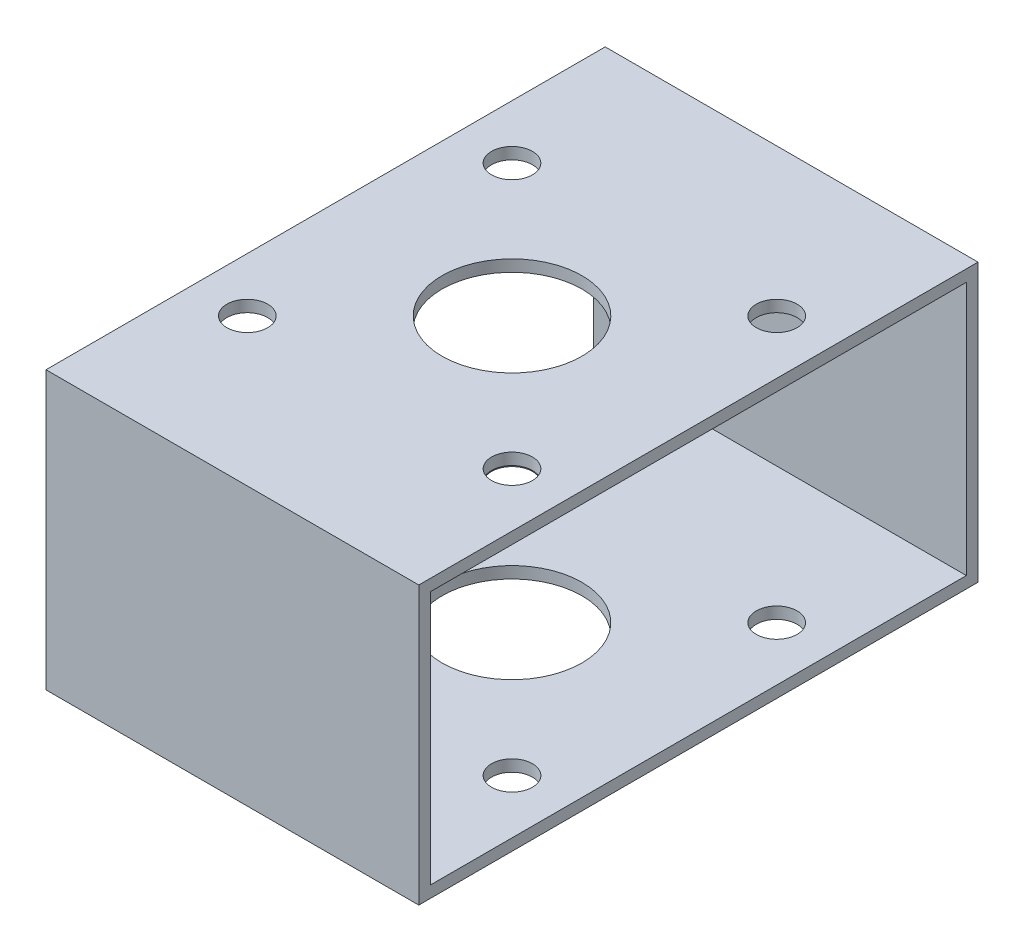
ISO-10303-21;
HEADER;
FILE_DESCRIPTION(('STEP AP214'),'2;1');
FILE_NAME('part.step','',(''),(''),'','','');
FILE_SCHEMA(('AUTOMOTIVE_DESIGN { 1 0 10303 214 1 1 1 1 }'));
ENDSEC;
DATA;
#1=APPLICATION_CONTEXT('core data for automotive mechanical design processes');
#2=APPLICATION_PROTOCOL_DEFINITION('international standard','automotive_design',2000,#1);
#3=PRODUCT_CONTEXT('',#1,'mechanical');
#4=PRODUCT('Part','Part','',(#3));
#5=PRODUCT_RELATED_PRODUCT_CATEGORY('part','',(#4));
#6=PRODUCT_DEFINITION_FORMATION('','',#4);
#7=PRODUCT_DEFINITION_CONTEXT('part definition',#1,'design');
#8=PRODUCT_DEFINITION('design','',#6,#7);
#9=PRODUCT_DEFINITION_SHAPE('','',#8);
#10=(LENGTH_UNIT() NAMED_UNIT(*) SI_UNIT(.MILLI.,.METRE.));
#11=(NAMED_UNIT(*) PLANE_ANGLE_UNIT() SI_UNIT($,.RADIAN.));
#12=(NAMED_UNIT(*) SI_UNIT($,.STERADIAN.) SOLID_ANGLE_UNIT());
#13=UNCERTAINTY_MEASURE_WITH_UNIT(LENGTH_MEASURE(1.E-05),#10,'distance_accuracy_value','');
#14=(GEOMETRIC_REPRESENTATION_CONTEXT(3) GLOBAL_UNCERTAINTY_ASSIGNED_CONTEXT((#13)) GLOBAL_UNIT_ASSIGNED_CONTEXT((#10,
#11,#12)) REPRESENTATION_CONTEXT('',''));
#15=CARTESIAN_POINT('',(0.,0.,0.));
#16=DIRECTION('',(0.,0.,1.));
#17=DIRECTION('',(1.,0.,0.));
#18=AXIS2_PLACEMENT_3D('',#15,#16,#17);
#19=CARTESIAN_POINT('',(50.8,37.7825,76.2));
#20=DIRECTION('',(-1.,0.,0.));
#21=DIRECTION('',(0.,0.,1.));
#22=AXIS2_PLACEMENT_3D('',#19,#20,#21);
#23=PLANE('',#22);
#24=DIRECTION('',(0.,-1.,0.));
#25=VECTOR('',#24,1.);
#26=CARTESIAN_POINT('',(50.8,37.7825,76.2));
#27=LINE('',#26,#25);
#28=CARTESIAN_POINT('',(50.8,37.7825,76.2));
#29=VERTEX_POINT('',#28);
#30=CARTESIAN_POINT('',(50.8,-37.7825,76.2));
#31=VERTEX_POINT('',#30);
#32=EDGE_CURVE('E106',#29,#31,#27,.T.);
#33=ORIENTED_EDGE('',*,*,#32,.T.);
#34=DIRECTION('',(0.,0.,-1.));
#35=VECTOR('',#34,1.);
#36=CARTESIAN_POINT('',(50.8,-37.7825,76.2));
#37=LINE('',#36,#35);
#38=CARTESIAN_POINT('',(50.8,-37.7825,-76.2));
#39=VERTEX_POINT('',#38);
#40=EDGE_CURVE('E154',#31,#39,#37,.T.);
#41=ORIENTED_EDGE('',*,*,#40,.T.);
#42=DIRECTION('',(0.,1.,0.));
#43=VECTOR('',#42,1.);
#44=CARTESIAN_POINT('',(50.8,37.7825,-76.2));
#45=LINE('',#44,#43);
#46=CARTESIAN_POINT('',(50.8,37.7825,-76.2));
#47=VERTEX_POINT('',#46);
#48=EDGE_CURVE('E156',#39,#47,#45,.T.);
#49=ORIENTED_EDGE('',*,*,#48,.T.);
#50=DIRECTION('',(0.,0.,1.));
#51=VECTOR('',#50,1.);
#52=CARTESIAN_POINT('',(50.8,37.7825,76.2));
#53=LINE('',#52,#51);
#54=EDGE_CURVE('E53',#47,#29,#53,.T.);
#55=ORIENTED_EDGE('',*,*,#54,.T.);
#56=EDGE_LOOP('',(#33,#41,#49,#55));
#57=FACE_BOUND('',#56,.T.);
#58=DIRECTION('',(0.,-1.,0.));
#59=VECTOR('',#58,1.);
#60=CARTESIAN_POINT('',(50.8,37.7825,73.025));
#61=LINE('',#60,#59);
#62=CARTESIAN_POINT('',(50.8,34.6075,73.025));
#63=VERTEX_POINT('',#62);
#64=CARTESIAN_POINT('',(50.8,-34.6075,73.025));
#65=VERTEX_POINT('',#64);
#66=EDGE_CURVE('E103',#63,#65,#61,.T.);
#67=ORIENTED_EDGE('',*,*,#66,.F.);
#68=DIRECTION('',(0.,0.,1.));
#69=VECTOR('',#68,1.);
#70=CARTESIAN_POINT('',(50.8,34.6075,76.2));
#71=LINE('',#70,#69);
#72=CARTESIAN_POINT('',(50.8,34.6075,-73.025));
#73=VERTEX_POINT('',#72);
#74=EDGE_CURVE('E147',#73,#63,#71,.T.);
#75=ORIENTED_EDGE('',*,*,#74,.F.);
#76=DIRECTION('',(0.,1.,0.));
#77=VECTOR('',#76,1.);
#78=CARTESIAN_POINT('',(50.8,37.7825,-73.025));
#79=LINE('',#78,#77);
#80=CARTESIAN_POINT('',(50.8,-34.6075,-73.025));
#81=VERTEX_POINT('',#80);
#82=EDGE_CURVE('E145',#81,#73,#79,.T.);
#83=ORIENTED_EDGE('',*,*,#82,.F.);
#84=DIRECTION('',(0.,0.,-1.));
#85=VECTOR('',#84,1.);
#86=CARTESIAN_POINT('',(50.8,-34.6075,76.2));
#87=LINE('',#86,#85);
#88=EDGE_CURVE('E143',#65,#81,#87,.T.);
#89=ORIENTED_EDGE('',*,*,#88,.F.);
#90=EDGE_LOOP('',(#67,#75,#83,#89));
#91=FACE_BOUND('',#90,.T.);
#92=ADVANCED_FACE('F30',(#57,#91),#23,.F.);
#93=CARTESIAN_POINT('',(50.8,37.7825,76.2));
#94=DIRECTION('',(0.,0.,-1.));
#95=DIRECTION('',(0.,1.,0.));
#96=AXIS2_PLACEMENT_3D('',#93,#94,#95);
#97=PLANE('',#96);
#98=DIRECTION('',(-1.,0.,0.));
#99=VECTOR('',#98,1.);
#100=CARTESIAN_POINT('',(50.8,37.7825,76.2));
#101=LINE('',#100,#99);
#102=CARTESIAN_POINT('',(-50.8,37.7825,76.2));
#103=VERTEX_POINT('',#102);
#104=EDGE_CURVE('E159',#29,#103,#101,.T.);
#105=ORIENTED_EDGE('',*,*,#104,.T.);
#106=DIRECTION('',(0.,-1.,0.));
#107=VECTOR('',#106,1.);
#108=CARTESIAN_POINT('',(-50.8,37.7825,76.2));
#109=LINE('',#108,#107);
#110=CARTESIAN_POINT('',(-50.8,-37.7825,76.2));
#111=VERTEX_POINT('',#110);
#112=EDGE_CURVE('E130',#103,#111,#109,.T.);
#113=ORIENTED_EDGE('',*,*,#112,.T.);
#114=DIRECTION('',(-1.,0.,0.));
#115=VECTOR('',#114,1.);
#116=CARTESIAN_POINT('',(50.8,-37.7825,76.2));
#117=LINE('',#116,#115);
#118=EDGE_CURVE('E11',#31,#111,#117,.T.);
#119=ORIENTED_EDGE('',*,*,#118,.F.);
#120=ORIENTED_EDGE('',*,*,#32,.F.);
#121=EDGE_LOOP('',(#105,#113,#119,#120));
#122=FACE_BOUND('',#121,.T.);
#123=ADVANCED_FACE('F32',(#122),#97,.F.);
#124=CARTESIAN_POINT('',(50.8,-37.7825,76.2));
#125=DIRECTION('',(0.,1.,0.));
#126=DIRECTION('',(0.,0.,1.));
#127=AXIS2_PLACEMENT_3D('',#124,#125,#126);
#128=PLANE('',#127);
#129=CARTESIAN_POINT('',(-36.068,-37.7825,-36.068));
#130=DIRECTION('',(0.,-1.,0.));
#131=DIRECTION('',(0.,0.,-1.));
#132=AXIS2_PLACEMENT_3D('',#129,#130,#131);
#133=CIRCLE('',#132,5.5626);
#134=CARTESIAN_POINT('',(-36.068,-37.7825,-41.6306));
#135=VERTEX_POINT('',#134);
#136=EDGE_CURVE('E256',#135,#135,#133,.T.);
#137=ORIENTED_EDGE('',*,*,#136,.F.);
#138=EDGE_LOOP('',(#137));
#139=FACE_BOUND('',#138,.T.);
#140=CARTESIAN_POINT('',(36.068,-37.7825,-36.068));
#141=DIRECTION('',(0.,-1.,0.));
#142=DIRECTION('',(0.,0.,-1.));
#143=AXIS2_PLACEMENT_3D('',#140,#141,#142);
#144=CIRCLE('',#143,5.5626);
#145=CARTESIAN_POINT('',(36.068,-37.7825,-41.6306));
#146=VERTEX_POINT('',#145);
#147=EDGE_CURVE('E261',#146,#146,#144,.T.);
#148=ORIENTED_EDGE('',*,*,#147,.F.);
#149=EDGE_LOOP('',(#148));
#150=FACE_BOUND('',#149,.T.);
#151=CARTESIAN_POINT('',(36.068,-37.7825,36.068));
#152=DIRECTION('',(0.,-1.,0.));
#153=DIRECTION('',(0.,0.,-1.));
#154=AXIS2_PLACEMENT_3D('',#151,#152,#153);
#155=CIRCLE('',#154,5.5626);
#156=CARTESIAN_POINT('',(36.068,-37.7825,30.5054));
#157=VERTEX_POINT('',#156);
#158=EDGE_CURVE('E268',#157,#157,#155,.T.);
#159=ORIENTED_EDGE('',*,*,#158,.F.);
#160=EDGE_LOOP('',(#159));
#161=FACE_BOUND('',#160,.T.);
#162=CARTESIAN_POINT('',(-36.068,-37.7825,36.068));
#163=DIRECTION('',(0.,-1.,0.));
#164=DIRECTION('',(0.,0.,-1.));
#165=AXIS2_PLACEMENT_3D('',#162,#163,#164);
#166=CIRCLE('',#165,5.5626);
#167=CARTESIAN_POINT('',(-36.068,-37.7825,30.5054));
#168=VERTEX_POINT('',#167);
#169=EDGE_CURVE('E274',#168,#168,#166,.T.);
#170=ORIENTED_EDGE('',*,*,#169,.F.);
#171=EDGE_LOOP('',(#170));
#172=FACE_BOUND('',#171,.T.);
#173=CARTESIAN_POINT('',(0.,-37.7825,0.));
#174=DIRECTION('',(0.,-1.,0.));
#175=DIRECTION('',(0.,0.,-1.));
#176=AXIS2_PLACEMENT_3D('',#173,#174,#175);
#177=CIRCLE('',#176,19.05);
#178=CARTESIAN_POINT('',(0.,-37.7825,-19.05));
#179=VERTEX_POINT('',#178);
#180=EDGE_CURVE('E280',#179,#179,#177,.T.);
#181=ORIENTED_EDGE('',*,*,#180,.F.);
#182=EDGE_LOOP('',(#181));
#183=FACE_BOUND('',#182,.T.);
#184=ORIENTED_EDGE('',*,*,#118,.T.);
#185=DIRECTION('',(0.,0.,-1.));
#186=VECTOR('',#185,1.);
#187=CARTESIAN_POINT('',(-50.8,-37.7825,76.2));
#188=LINE('',#187,#186);
#189=CARTESIAN_POINT('',(-50.8,-37.7825,-76.2));
#190=VERTEX_POINT('',#189);
#191=EDGE_CURVE('E133',#111,#190,#188,.T.);
#192=ORIENTED_EDGE('',*,*,#191,.T.);
#193=DIRECTION('',(-1.,0.,0.));
#194=VECTOR('',#193,1.);
#195=CARTESIAN_POINT('',(50.8,-37.7825,-76.2));
#196=LINE('',#195,#194);
#197=EDGE_CURVE('E38',#39,#190,#196,.T.);
#198=ORIENTED_EDGE('',*,*,#197,.F.);
#199=ORIENTED_EDGE('',*,*,#40,.F.);
#200=EDGE_LOOP('',(#184,#192,#198,#199));
#201=FACE_BOUND('',#200,.T.);
#202=ADVANCED_FACE('F172',(#139,#150,#161,#172,#183,#201),#128,.F.);
#203=CARTESIAN_POINT('',(50.8,37.7825,-76.2));
#204=DIRECTION('',(0.,0.,1.));
#205=DIRECTION('',(0.,-1.,0.));
#206=AXIS2_PLACEMENT_3D('',#203,#204,#205);
#207=PLANE('',#206);
#208=ORIENTED_EDGE('',*,*,#197,.T.);
#209=DIRECTION('',(0.,1.,0.));
#210=VECTOR('',#209,1.);
#211=CARTESIAN_POINT('',(-50.8,37.7825,-76.2));
#212=LINE('',#211,#210);
#213=CARTESIAN_POINT('',(-50.8,37.7825,-76.2));
#214=VERTEX_POINT('',#213);
#215=EDGE_CURVE('E136',#190,#214,#212,.T.);
#216=ORIENTED_EDGE('',*,*,#215,.T.);
#217=DIRECTION('',(-1.,0.,0.));
#218=VECTOR('',#217,1.);
#219=CARTESIAN_POINT('',(50.8,37.7825,-76.2));
#220=LINE('',#219,#218);
#221=EDGE_CURVE('E161',#47,#214,#220,.T.);
#222=ORIENTED_EDGE('',*,*,#221,.F.);
#223=ORIENTED_EDGE('',*,*,#48,.F.);
#224=EDGE_LOOP('',(#208,#216,#222,#223));
#225=FACE_BOUND('',#224,.T.);
#226=ADVANCED_FACE('F166',(#225),#207,.F.);
#227=CARTESIAN_POINT('',(50.8,37.7825,76.2));
#228=DIRECTION('',(0.,-1.,0.));
#229=DIRECTION('',(0.,0.,-1.));
#230=AXIS2_PLACEMENT_3D('',#227,#228,#229);
#231=PLANE('',#230);
#232=CARTESIAN_POINT('',(36.068,37.7825,-36.068));
#233=DIRECTION('',(0.,1.,0.));
#234=DIRECTION('',(0.,0.,1.));
#235=AXIS2_PLACEMENT_3D('',#232,#233,#234);
#236=CIRCLE('',#235,5.5626);
#237=CARTESIAN_POINT('',(36.068,37.7825,-30.5054));
#238=VERTEX_POINT('',#237);
#239=EDGE_CURVE('E286',#238,#238,#236,.T.);
#240=ORIENTED_EDGE('',*,*,#239,.F.);
#241=EDGE_LOOP('',(#240));
#242=FACE_BOUND('',#241,.T.);
#243=CARTESIAN_POINT('',(-36.068,37.7825,-36.068));
#244=DIRECTION('',(0.,1.,0.));
#245=DIRECTION('',(0.,0.,1.));
#246=AXIS2_PLACEMENT_3D('',#243,#244,#245);
#247=CIRCLE('',#246,5.5626);
#248=CARTESIAN_POINT('',(-36.068,37.7825,-30.5054));
#249=VERTEX_POINT('',#248);
#250=EDGE_CURVE('E292',#249,#249,#247,.T.);
#251=ORIENTED_EDGE('',*,*,#250,.F.);
#252=EDGE_LOOP('',(#251));
#253=FACE_BOUND('',#252,.T.);
#254=CARTESIAN_POINT('',(-36.068,37.7825,36.068));
#255=DIRECTION('',(0.,1.,0.));
#256=DIRECTION('',(0.,0.,1.));
#257=AXIS2_PLACEMENT_3D('',#254,#255,#256);
#258=CIRCLE('',#257,5.5626);
#259=CARTESIAN_POINT('',(-36.068,37.7825,41.6306));
#260=VERTEX_POINT('',#259);
#261=EDGE_CURVE('E298',#260,#260,#258,.T.);
#262=ORIENTED_EDGE('',*,*,#261,.F.);
#263=EDGE_LOOP('',(#262));
#264=FACE_BOUND('',#263,.T.);
#265=CARTESIAN_POINT('',(36.068,37.7825,36.068));
#266=DIRECTION('',(0.,1.,0.));
#267=DIRECTION('',(0.,0.,1.));
#268=AXIS2_PLACEMENT_3D('',#265,#266,#267);
#269=CIRCLE('',#268,5.5626);
#270=CARTESIAN_POINT('',(36.068,37.7825,41.6306));
#271=VERTEX_POINT('',#270);
#272=EDGE_CURVE('E304',#271,#271,#269,.T.);
#273=ORIENTED_EDGE('',*,*,#272,.F.);
#274=EDGE_LOOP('',(#273));
#275=FACE_BOUND('',#274,.T.);
#276=CARTESIAN_POINT('',(0.,37.7825,0.));
#277=DIRECTION('',(0.,1.,0.));
#278=DIRECTION('',(0.,0.,1.));
#279=AXIS2_PLACEMENT_3D('',#276,#277,#278);
#280=CIRCLE('',#279,19.05);
#281=CARTESIAN_POINT('',(0.,37.7825,19.05));
#282=VERTEX_POINT('',#281);
#283=EDGE_CURVE('E121',#282,#282,#280,.T.);
#284=ORIENTED_EDGE('',*,*,#283,.F.);
#285=EDGE_LOOP('',(#284));
#286=FACE_BOUND('',#285,.T.);
#287=ORIENTED_EDGE('',*,*,#221,.T.);
#288=DIRECTION('',(0.,0.,1.));
#289=VECTOR('',#288,1.);
#290=CARTESIAN_POINT('',(-50.8,37.7825,76.2));
#291=LINE('',#290,#289);
#292=EDGE_CURVE('E139',#214,#103,#291,.T.);
#293=ORIENTED_EDGE('',*,*,#292,.T.);
#294=ORIENTED_EDGE('',*,*,#104,.F.);
#295=ORIENTED_EDGE('',*,*,#54,.F.);
#296=EDGE_LOOP('',(#287,#293,#294,#295));
#297=FACE_BOUND('',#296,.T.);
#298=ADVANCED_FACE('F177',(#242,#253,#264,#275,#286,#297),#231,.F.);
#299=CARTESIAN_POINT('',(50.8,37.7825,73.025));
#300=DIRECTION('',(0.,0.,-1.));
#301=DIRECTION('',(0.,1.,0.));
#302=AXIS2_PLACEMENT_3D('',#299,#300,#301);
#303=PLANE('',#302);
#304=DIRECTION('',(-1.,0.,0.));
#305=VECTOR('',#304,1.);
#306=CARTESIAN_POINT('',(50.8,-34.6075,73.025));
#307=LINE('',#306,#305);
#308=CARTESIAN_POINT('',(-50.8,-34.6075,73.025));
#309=VERTEX_POINT('',#308);
#310=EDGE_CURVE('E95',#65,#309,#307,.T.);
#311=ORIENTED_EDGE('',*,*,#310,.T.);
#312=DIRECTION('',(0.,-1.,0.));
#313=VECTOR('',#312,1.);
#314=CARTESIAN_POINT('',(-50.8,37.7825,73.025));
#315=LINE('',#314,#313);
#316=CARTESIAN_POINT('',(-50.8,34.6075,73.025));
#317=VERTEX_POINT('',#316);
#318=EDGE_CURVE('E100',#317,#309,#315,.T.);
#319=ORIENTED_EDGE('',*,*,#318,.F.);
#320=DIRECTION('',(-1.,0.,0.));
#321=VECTOR('',#320,1.);
#322=CARTESIAN_POINT('',(50.8,34.6075,73.025));
#323=LINE('',#322,#321);
#324=EDGE_CURVE('E149',#63,#317,#323,.T.);
#325=ORIENTED_EDGE('',*,*,#324,.F.);
#326=ORIENTED_EDGE('',*,*,#66,.T.);
#327=EDGE_LOOP('',(#311,#319,#325,#326));
#328=FACE_BOUND('',#327,.T.);
#329=ADVANCED_FACE('F97',(#328),#303,.T.);
#330=CARTESIAN_POINT('',(50.8,-34.6075,76.2));
#331=DIRECTION('',(0.,1.,0.));
#332=DIRECTION('',(0.,0.,1.));
#333=AXIS2_PLACEMENT_3D('',#330,#331,#332);
#334=PLANE('',#333);
#335=CARTESIAN_POINT('',(-36.068,-34.6075,-36.068));
#336=DIRECTION('',(0.,1.,0.));
#337=DIRECTION('',(0.,0.,1.));
#338=AXIS2_PLACEMENT_3D('',#335,#336,#337);
#339=CIRCLE('',#338,5.5626);
#340=CARTESIAN_POINT('',(-36.068,-34.6075,-30.5054));
#341=VERTEX_POINT('',#340);
#342=EDGE_CURVE('E253',#341,#341,#339,.F.);
#343=ORIENTED_EDGE('',*,*,#342,.T.);
#344=EDGE_LOOP('',(#343));
#345=FACE_BOUND('',#344,.T.);
#346=CARTESIAN_POINT('',(36.068,-34.6075,-36.068));
#347=DIRECTION('',(0.,1.,0.));
#348=DIRECTION('',(0.,0.,1.));
#349=AXIS2_PLACEMENT_3D('',#346,#347,#348);
#350=CIRCLE('',#349,5.5626);
#351=CARTESIAN_POINT('',(36.068,-34.6075,-30.5054));
#352=VERTEX_POINT('',#351);
#353=EDGE_CURVE('E258',#352,#352,#350,.F.);
#354=ORIENTED_EDGE('',*,*,#353,.T.);
#355=EDGE_LOOP('',(#354));
#356=FACE_BOUND('',#355,.T.);
#357=CARTESIAN_POINT('',(36.068,-34.6075,36.068));
#358=DIRECTION('',(0.,1.,0.));
#359=DIRECTION('',(0.,0.,1.));
#360=AXIS2_PLACEMENT_3D('',#357,#358,#359);
#361=CIRCLE('',#360,5.5626);
#362=CARTESIAN_POINT('',(36.068,-34.6075,41.6306));
#363=VERTEX_POINT('',#362);
#364=EDGE_CURVE('E266',#363,#363,#361,.F.);
#365=ORIENTED_EDGE('',*,*,#364,.T.);
#366=EDGE_LOOP('',(#365));
#367=FACE_BOUND('',#366,.T.);
#368=CARTESIAN_POINT('',(-36.068,-34.6075,36.068));
#369=DIRECTION('',(0.,1.,0.));
#370=DIRECTION('',(0.,0.,1.));
#371=AXIS2_PLACEMENT_3D('',#368,#369,#370);
#372=CIRCLE('',#371,5.5626);
#373=CARTESIAN_POINT('',(-36.068,-34.6075,41.6306));
#374=VERTEX_POINT('',#373);
#375=EDGE_CURVE('E271',#374,#374,#372,.F.);
#376=ORIENTED_EDGE('',*,*,#375,.T.);
#377=EDGE_LOOP('',(#376));
#378=FACE_BOUND('',#377,.T.);
#379=CARTESIAN_POINT('',(0.,-34.6075,0.));
#380=DIRECTION('',(0.,1.,0.));
#381=DIRECTION('',(0.,0.,1.));
#382=AXIS2_PLACEMENT_3D('',#379,#380,#381);
#383=CIRCLE('',#382,19.05);
#384=CARTESIAN_POINT('',(0.,-34.6075,19.05));
#385=VERTEX_POINT('',#384);
#386=EDGE_CURVE('E277',#385,#385,#383,.F.);
#387=ORIENTED_EDGE('',*,*,#386,.T.);
#388=EDGE_LOOP('',(#387));
#389=FACE_BOUND('',#388,.T.);
#390=DIRECTION('',(-1.,0.,0.));
#391=VECTOR('',#390,1.);
#392=CARTESIAN_POINT('',(50.8,-34.6075,-73.025));
#393=LINE('',#392,#391);
#394=CARTESIAN_POINT('',(-50.8,-34.6075,-73.025));
#395=VERTEX_POINT('',#394);
#396=EDGE_CURVE('E107',#81,#395,#393,.T.);
#397=ORIENTED_EDGE('',*,*,#396,.T.);
#398=DIRECTION('',(0.,0.,-1.));
#399=VECTOR('',#398,1.);
#400=CARTESIAN_POINT('',(-50.8,-34.6075,76.2));
#401=LINE('',#400,#399);
#402=EDGE_CURVE('E110',#309,#395,#401,.T.);
#403=ORIENTED_EDGE('',*,*,#402,.F.);
#404=ORIENTED_EDGE('',*,*,#310,.F.);
#405=ORIENTED_EDGE('',*,*,#88,.T.);
#406=EDGE_LOOP('',(#397,#403,#404,#405));
#407=FACE_BOUND('',#406,.T.);
#408=ADVANCED_FACE('F111',(#345,#356,#367,#378,#389,#407),#334,.T.);
#409=CARTESIAN_POINT('',(50.8,37.7825,-73.025));
#410=DIRECTION('',(0.,0.,1.));
#411=DIRECTION('',(0.,-1.,0.));
#412=AXIS2_PLACEMENT_3D('',#409,#410,#411);
#413=PLANE('',#412);
#414=DIRECTION('',(-1.,0.,0.));
#415=VECTOR('',#414,1.);
#416=CARTESIAN_POINT('',(50.8,34.6075,-73.025));
#417=LINE('',#416,#415);
#418=CARTESIAN_POINT('',(-50.8,34.6075,-73.025));
#419=VERTEX_POINT('',#418);
#420=EDGE_CURVE('E45',#73,#419,#417,.T.);
#421=ORIENTED_EDGE('',*,*,#420,.T.);
#422=DIRECTION('',(0.,1.,0.));
#423=VECTOR('',#422,1.);
#424=CARTESIAN_POINT('',(-50.8,37.7825,-73.025));
#425=LINE('',#424,#423);
#426=EDGE_CURVE('E116',#395,#419,#425,.T.);
#427=ORIENTED_EDGE('',*,*,#426,.F.);
#428=ORIENTED_EDGE('',*,*,#396,.F.);
#429=ORIENTED_EDGE('',*,*,#82,.T.);
#430=EDGE_LOOP('',(#421,#427,#428,#429));
#431=FACE_BOUND('',#430,.T.);
#432=ADVANCED_FACE('F198',(#431),#413,.T.);
#433=CARTESIAN_POINT('',(50.8,34.6075,76.2));
#434=DIRECTION('',(0.,-1.,0.));
#435=DIRECTION('',(0.,0.,-1.));
#436=AXIS2_PLACEMENT_3D('',#433,#434,#435);
#437=PLANE('',#436);
#438=CARTESIAN_POINT('',(36.068,34.6075,-36.068));
#439=DIRECTION('',(0.,-1.,0.));
#440=DIRECTION('',(0.,0.,-1.));
#441=AXIS2_PLACEMENT_3D('',#438,#439,#440);
#442=CIRCLE('',#441,5.5626);
#443=CARTESIAN_POINT('',(36.068,34.6075,-41.6306));
#444=VERTEX_POINT('',#443);
#445=EDGE_CURVE('E283',#444,#444,#442,.F.);
#446=ORIENTED_EDGE('',*,*,#445,.T.);
#447=EDGE_LOOP('',(#446));
#448=FACE_BOUND('',#447,.T.);
#449=CARTESIAN_POINT('',(-36.068,34.6075,-36.068));
#450=DIRECTION('',(0.,-1.,0.));
#451=DIRECTION('',(0.,0.,-1.));
#452=AXIS2_PLACEMENT_3D('',#449,#450,#451);
#453=CIRCLE('',#452,5.5626);
#454=CARTESIAN_POINT('',(-36.068,34.6075,-41.6306));
#455=VERTEX_POINT('',#454);
#456=EDGE_CURVE('E289',#455,#455,#453,.F.);
#457=ORIENTED_EDGE('',*,*,#456,.T.);
#458=EDGE_LOOP('',(#457));
#459=FACE_BOUND('',#458,.T.);
#460=CARTESIAN_POINT('',(-36.068,34.6075,36.068));
#461=DIRECTION('',(0.,-1.,0.));
#462=DIRECTION('',(0.,0.,-1.));
#463=AXIS2_PLACEMENT_3D('',#460,#461,#462);
#464=CIRCLE('',#463,5.5626);
#465=CARTESIAN_POINT('',(-36.068,34.6075,30.5054));
#466=VERTEX_POINT('',#465);
#467=EDGE_CURVE('E295',#466,#466,#464,.F.);
#468=ORIENTED_EDGE('',*,*,#467,.T.);
#469=EDGE_LOOP('',(#468));
#470=FACE_BOUND('',#469,.T.);
#471=CARTESIAN_POINT('',(36.068,34.6075,36.068));
#472=DIRECTION('',(0.,-1.,0.));
#473=DIRECTION('',(0.,0.,-1.));
#474=AXIS2_PLACEMENT_3D('',#471,#472,#473);
#475=CIRCLE('',#474,5.5626);
#476=CARTESIAN_POINT('',(36.068,34.6075,30.5054));
#477=VERTEX_POINT('',#476);
#478=EDGE_CURVE('E301',#477,#477,#475,.F.);
#479=ORIENTED_EDGE('',*,*,#478,.T.);
#480=EDGE_LOOP('',(#479));
#481=FACE_BOUND('',#480,.T.);
#482=CARTESIAN_POINT('',(0.,34.6075,0.));
#483=DIRECTION('',(0.,-1.,0.));
#484=DIRECTION('',(0.,0.,-1.));
#485=AXIS2_PLACEMENT_3D('',#482,#483,#484);
#486=CIRCLE('',#485,19.05);
#487=CARTESIAN_POINT('',(0.,34.6075,-19.05));
#488=VERTEX_POINT('',#487);
#489=EDGE_CURVE('E124',#488,#488,#486,.F.);
#490=ORIENTED_EDGE('',*,*,#489,.T.);
#491=EDGE_LOOP('',(#490));
#492=FACE_BOUND('',#491,.T.);
#493=ORIENTED_EDGE('',*,*,#324,.T.);
#494=DIRECTION('',(0.,0.,1.));
#495=VECTOR('',#494,1.);
#496=CARTESIAN_POINT('',(-50.8,34.6075,76.2));
#497=LINE('',#496,#495);
#498=EDGE_CURVE('E120',#419,#317,#497,.T.);
#499=ORIENTED_EDGE('',*,*,#498,.F.);
#500=ORIENTED_EDGE('',*,*,#420,.F.);
#501=ORIENTED_EDGE('',*,*,#74,.T.);
#502=EDGE_LOOP('',(#493,#499,#500,#501));
#503=FACE_BOUND('',#502,.T.);
#504=ADVANCED_FACE('F202',(#448,#459,#470,#481,#492,#503),#437,.T.);
#505=CARTESIAN_POINT('',(-50.8,37.7825,76.2));
#506=DIRECTION('',(-1.,0.,0.));
#507=DIRECTION('',(0.,0.,1.));
#508=AXIS2_PLACEMENT_3D('',#505,#506,#507);
#509=PLANE('',#508);
#510=ORIENTED_EDGE('',*,*,#318,.T.);
#511=ORIENTED_EDGE('',*,*,#402,.T.);
#512=ORIENTED_EDGE('',*,*,#426,.T.);
#513=ORIENTED_EDGE('',*,*,#498,.T.);
#514=EDGE_LOOP('',(#510,#511,#512,#513));
#515=FACE_BOUND('',#514,.T.);
#516=ORIENTED_EDGE('',*,*,#112,.F.);
#517=ORIENTED_EDGE('',*,*,#292,.F.);
#518=ORIENTED_EDGE('',*,*,#215,.F.);
#519=ORIENTED_EDGE('',*,*,#191,.F.);
#520=EDGE_LOOP('',(#516,#517,#518,#519));
#521=FACE_BOUND('',#520,.T.);
#522=ADVANCED_FACE('F118',(#515,#521),#509,.T.);
#523=CARTESIAN_POINT('',(0.,-37.7835,0.));
#524=DIRECTION('',(0.,1.,0.));
#525=DIRECTION('',(0.,0.,1.));
#526=AXIS2_PLACEMENT_3D('',#523,#524,#525);
#527=CYLINDRICAL_SURFACE('',#526,19.05);
#528=ORIENTED_EDGE('',*,*,#489,.F.);
#529=EDGE_LOOP('',(#528));
#530=FACE_BOUND('',#529,.T.);
#531=ORIENTED_EDGE('',*,*,#283,.T.);
#532=EDGE_LOOP('',(#531));
#533=FACE_BOUND('',#532,.T.);
#534=ADVANCED_FACE('F209',(#530,#533),#527,.F.);
#535=CARTESIAN_POINT('',(36.068,-37.7835,36.068));
#536=DIRECTION('',(0.,1.,0.));
#537=DIRECTION('',(0.,0.,1.));
#538=AXIS2_PLACEMENT_3D('',#535,#536,#537);
#539=CYLINDRICAL_SURFACE('',#538,5.5626);
#540=ORIENTED_EDGE('',*,*,#478,.F.);
#541=EDGE_LOOP('',(#540));
#542=FACE_BOUND('',#541,.T.);
#543=ORIENTED_EDGE('',*,*,#272,.T.);
#544=EDGE_LOOP('',(#543));
#545=FACE_BOUND('',#544,.T.);
#546=ADVANCED_FACE('F212',(#542,#545),#539,.F.);
#547=CARTESIAN_POINT('',(-36.068,-37.7835,36.068));
#548=DIRECTION('',(0.,1.,0.));
#549=DIRECTION('',(0.,0.,1.));
#550=AXIS2_PLACEMENT_3D('',#547,#548,#549);
#551=CYLINDRICAL_SURFACE('',#550,5.5626);
#552=ORIENTED_EDGE('',*,*,#467,.F.);
#553=EDGE_LOOP('',(#552));
#554=FACE_BOUND('',#553,.T.);
#555=ORIENTED_EDGE('',*,*,#261,.T.);
#556=EDGE_LOOP('',(#555));
#557=FACE_BOUND('',#556,.T.);
#558=ADVANCED_FACE('F216',(#554,#557),#551,.F.);
#559=CARTESIAN_POINT('',(-36.068,-37.7835,-36.068));
#560=DIRECTION('',(0.,1.,0.));
#561=DIRECTION('',(0.,0.,1.));
#562=AXIS2_PLACEMENT_3D('',#559,#560,#561);
#563=CYLINDRICAL_SURFACE('',#562,5.5626);
#564=ORIENTED_EDGE('',*,*,#456,.F.);
#565=EDGE_LOOP('',(#564));
#566=FACE_BOUND('',#565,.T.);
#567=ORIENTED_EDGE('',*,*,#250,.T.);
#568=EDGE_LOOP('',(#567));
#569=FACE_BOUND('',#568,.T.);
#570=ADVANCED_FACE('F220',(#566,#569),#563,.F.);
#571=CARTESIAN_POINT('',(36.068,-37.7835,-36.068));
#572=DIRECTION('',(0.,1.,0.));
#573=DIRECTION('',(0.,0.,1.));
#574=AXIS2_PLACEMENT_3D('',#571,#572,#573);
#575=CYLINDRICAL_SURFACE('',#574,5.5626);
#576=ORIENTED_EDGE('',*,*,#445,.F.);
#577=EDGE_LOOP('',(#576));
#578=FACE_BOUND('',#577,.T.);
#579=ORIENTED_EDGE('',*,*,#239,.T.);
#580=EDGE_LOOP('',(#579));
#581=FACE_BOUND('',#580,.T.);
#582=ADVANCED_FACE('F224',(#578,#581),#575,.F.);
#583=CARTESIAN_POINT('',(0.,37.7835,0.));
#584=DIRECTION('',(0.,-1.,0.));
#585=DIRECTION('',(0.,0.,-1.));
#586=AXIS2_PLACEMENT_3D('',#583,#584,#585);
#587=CYLINDRICAL_SURFACE('',#586,19.05);
#588=ORIENTED_EDGE('',*,*,#386,.F.);
#589=EDGE_LOOP('',(#588));
#590=FACE_BOUND('',#589,.T.);
#591=ORIENTED_EDGE('',*,*,#180,.T.);
#592=EDGE_LOOP('',(#591));
#593=FACE_BOUND('',#592,.T.);
#594=ADVANCED_FACE('F228',(#590,#593),#587,.F.);
#595=CARTESIAN_POINT('',(-36.068,37.7835,36.068));
#596=DIRECTION('',(0.,-1.,0.));
#597=DIRECTION('',(0.,0.,-1.));
#598=AXIS2_PLACEMENT_3D('',#595,#596,#597);
#599=CYLINDRICAL_SURFACE('',#598,5.5626);
#600=ORIENTED_EDGE('',*,*,#375,.F.);
#601=EDGE_LOOP('',(#600));
#602=FACE_BOUND('',#601,.T.);
#603=ORIENTED_EDGE('',*,*,#169,.T.);
#604=EDGE_LOOP('',(#603));
#605=FACE_BOUND('',#604,.T.);
#606=ADVANCED_FACE('F232',(#602,#605),#599,.F.);
#607=CARTESIAN_POINT('',(36.068,37.7835,36.068));
#608=DIRECTION('',(0.,-1.,0.));
#609=DIRECTION('',(0.,0.,-1.));
#610=AXIS2_PLACEMENT_3D('',#607,#608,#609);
#611=CYLINDRICAL_SURFACE('',#610,5.5626);
#612=ORIENTED_EDGE('',*,*,#364,.F.);
#613=EDGE_LOOP('',(#612));
#614=FACE_BOUND('',#613,.T.);
#615=ORIENTED_EDGE('',*,*,#158,.T.);
#616=EDGE_LOOP('',(#615));
#617=FACE_BOUND('',#616,.T.);
#618=ADVANCED_FACE('F236',(#614,#617),#611,.F.);
#619=CARTESIAN_POINT('',(36.068,37.7835,-36.068));
#620=DIRECTION('',(0.,-1.,0.));
#621=DIRECTION('',(0.,0.,-1.));
#622=AXIS2_PLACEMENT_3D('',#619,#620,#621);
#623=CYLINDRICAL_SURFACE('',#622,5.5626);
#624=ORIENTED_EDGE('',*,*,#353,.F.);
#625=EDGE_LOOP('',(#624));
#626=FACE_BOUND('',#625,.T.);
#627=ORIENTED_EDGE('',*,*,#147,.T.);
#628=EDGE_LOOP('',(#627));
#629=FACE_BOUND('',#628,.T.);
#630=ADVANCED_FACE('F240',(#626,#629),#623,.F.);
#631=CARTESIAN_POINT('',(-36.068,37.7835,-36.068));
#632=DIRECTION('',(0.,-1.,0.));
#633=DIRECTION('',(0.,0.,-1.));
#634=AXIS2_PLACEMENT_3D('',#631,#632,#633);
#635=CYLINDRICAL_SURFACE('',#634,5.5626);
#636=ORIENTED_EDGE('',*,*,#342,.F.);
#637=EDGE_LOOP('',(#636));
#638=FACE_BOUND('',#637,.T.);
#639=ORIENTED_EDGE('',*,*,#136,.T.);
#640=EDGE_LOOP('',(#639));
#641=FACE_BOUND('',#640,.T.);
#642=ADVANCED_FACE('F244',(#638,#641),#635,.F.);
#643=CLOSED_SHELL('',(#92,#123,#202,#226,#298,#329,#408,#432,#504,#522,#534,#546,#558,#570,#582,
#594,#606,#618,#630,#642));
#644=MANIFOLD_SOLID_BREP('B2',#643);
#645=ADVANCED_BREP_SHAPE_REPRESENTATION('',(#18,#644),#14);
#646=SHAPE_DEFINITION_REPRESENTATION(#9,#645);
ENDSEC;
END-ISO-10303-21;
